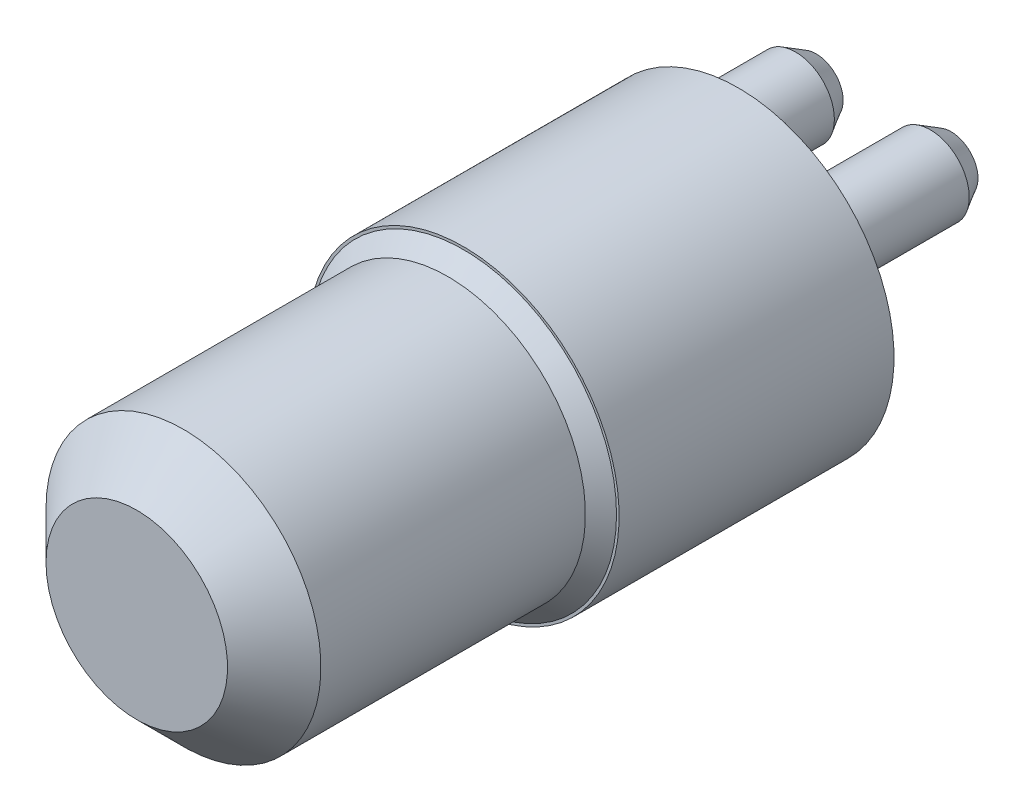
from build123d import *
from OCP.BRepFilletAPI import BRepFilletAPI_MakeChamfer

# Parameters (mm, degrees)
SKETCH1_R       = 7.62
BASE_DEPTH      = 13.462
SKETCH2_R       = 6.731
MOTOR_DEPTH     = 16.002
CHAMFER1_SIZE   = 2.286
SKETCH3_R       = 1.905
HOSE_BARB_DEPTH = 7.112
CHAMFER2_SIZE   = 0.762
CHAMFER4_SIZE   = 1.016
CHAMFER4_SIZE2  = 0.586587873


with BuildPart() as part:
    # Sketch1 → base (new body)
    with BuildSketch(Plane.XY):
        Circle(SKETCH1_R)
    extrude(amount=BASE_DEPTH)

    # Sketch2 → motor (add)
    with BuildSketch(Plane.XY.offset(13.462)):
        Circle(SKETCH2_R)
    extrude(amount=MOTOR_DEPTH)

    # Chamfer1
    chamfer1_edges = [part.edges().sort_by_distance(p)[0] for p in [
        (-6.731, 0, 29.464),
    ]]
    chamfer(chamfer1_edges, length=CHAMFER1_SIZE)

    # Sketch3 → hose_barb (add)
    with BuildSketch(Plane(origin=(0, 0, 0), x_dir=(-1, 0, 0), z_dir=(0, 0, -1))):
        with Locations(Location((-3.302, 2.54, 0), (0, 0, 180))):
            Circle(SKETCH3_R)
        with Locations(Location((3.302, 2.54, 0), (0, 0, 180))):
            Circle(SKETCH3_R)
    extrude(amount=HOSE_BARB_DEPTH)

    # Chamfer2
    chamfer2_edges = [part.edges().sort_by_distance(p)[0] for p in [
        (-6.731, 0, 13.462),
    ]]
    chamfer(chamfer2_edges, length=CHAMFER2_SIZE)

    # Chamfer4: one chamfer whose edges measure the first distance from different faces: ONE call of the kernel's chamfer builder (chamfer() names one face for all edges)
    chamfer4_edges_1 = [part.edges().sort_by_distance(p)[0] for p in [
        (1.397, 2.54, -7.112),
    ]]
    chamfer4_side_1 = [part.faces().sort_by_distance(p)[0] for p in [
        (1.397, 2.54, -3.556),
    ]]
    chamfer4_edges_2 = [part.edges().sort_by_distance(p)[0] for p in [
        (-5.207, 2.54, -7.112),
    ]]
    chamfer4_side_2 = [part.faces().sort_by_distance(p)[0] for p in [
        (-5.207, 2.54, -3.556),
    ]]
    chamfer4 = BRepFilletAPI_MakeChamfer(part.part.solid().wrapped)
    for e in chamfer4_edges_1:
        chamfer4.Add(CHAMFER4_SIZE, CHAMFER4_SIZE2, e.wrapped, chamfer4_side_1[0].wrapped)  # the first distance lies on this face
    for e in chamfer4_edges_2:
        chamfer4.Add(CHAMFER4_SIZE, CHAMFER4_SIZE2, e.wrapped, chamfer4_side_2[0].wrapped)  # the first distance lies on this face
    add(Compound.cast(chamfer4.Shape()), mode=Mode.REPLACE)


solid = part.part
